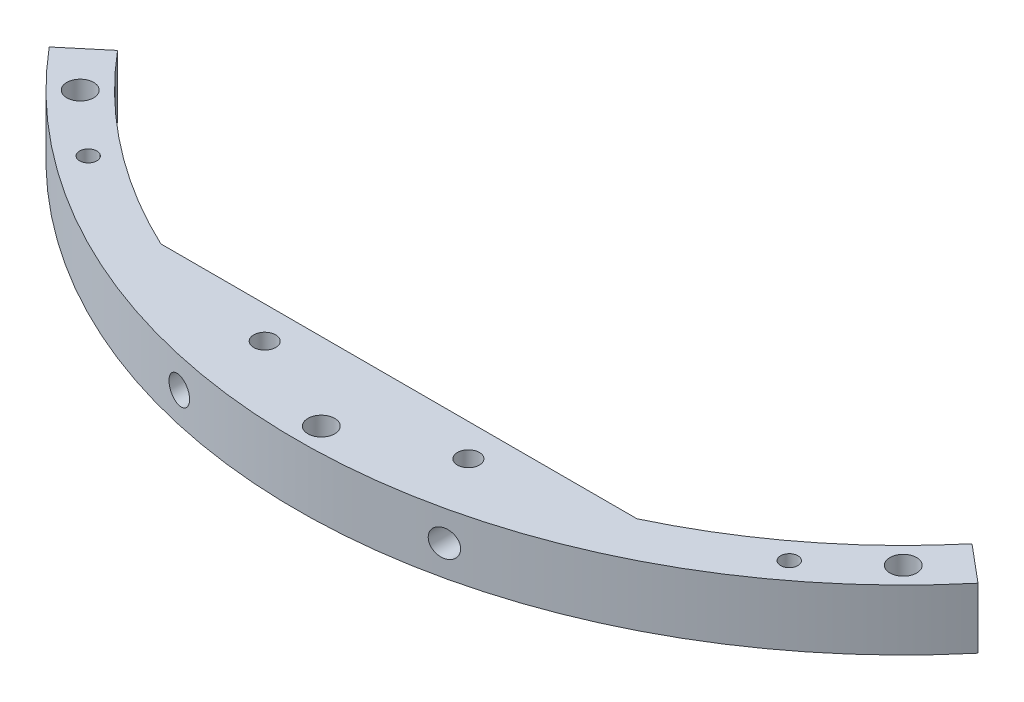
from build123d import *

# Parameters (mm, degrees)
SKETCH1_R          = 1.7272
SKETCH1_R_2        = 2.108199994
SKETCH1_R_3        = 1.352549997
SKETCH1_R_4        = 1.352549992
SKETCH1_R_5        = 2.1082
EXTRUDE1_DEPTH     = 9.525
SKETCH3_R          = 2.0828
CUT_EXTRUDE1_DEPTH = 78.071876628


with BuildPart() as part:
    # Sketch1 → Extrude1 (new body)
    with BuildSketch(Plane(origin=(0, 0, 0), x_dir=(1, 0, 0), z_dir=(0, 1, 0))):
        with BuildLine():
            Line((-67.128474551, -56.327478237), (-72.965733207, -61.225519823))
            ThreePointArc((-72.965733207, -61.225519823), (0, -95.25), (72.965733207, -61.225519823))
            Line((72.965733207, -61.225519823), (67.128474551, -56.327478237))
            ThreePointArc((67.128474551, -56.327478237), (53.506037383, -69.398277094), (37.400152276, -79.248000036))
            Line((37.400152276, -79.248000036), (-37.400152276, -79.248000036))
            ThreePointArc((-37.400152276, -79.248000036), (-53.506037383, -69.398277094), (-67.128474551, -56.327478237))
        make_face()
        with Locations(Location((-16.002, -84.328000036, 0), (0, 0, 90))):
            Circle(SKETCH1_R, mode=Mode.SUBTRACT)
        with Locations(Location((-64.657844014, -64.65784405, 0), (0, 0, 90))):
            Circle(SKETCH1_R_2, mode=Mode.SUBTRACT)
        with Locations(Location((-55.073032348, -72.989793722, 0), (0, 0, 90))):
            Circle(SKETCH1_R_3, mode=Mode.SUBTRACT)
        with Locations(Location((55.073032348, -72.989793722, 0), (0, 0, 90))):
            Circle(SKETCH1_R_4, mode=Mode.SUBTRACT)
        with Locations(Location((64.657844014, -64.65784405, 0), (0, 0, 90))):
            Circle(SKETCH1_R_2, mode=Mode.SUBTRACT)
        with Locations(Location((16.002, -84.328000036, 0), (0, 0, 90))):
            Circle(SKETCH1_R, mode=Mode.SUBTRACT)
        with Locations(Location((0, -91.440000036, 0), (0, 0, 90))):
            Circle(SKETCH1_R_5, mode=Mode.SUBTRACT)
    extrude(amount=EXTRUDE1_DEPTH)

    # Sketch3 → Cut-Extrude1 (cut, through all)
    with BuildSketch(Plane(origin=(0, 0, 79.248000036), x_dir=(-1, 0, 0), z_dir=(0, 0, -1))):
        with Locations((20.828, 4.7625)):
            Circle(SKETCH3_R)
        with Locations((-20.828, 4.7625)):
            Circle(SKETCH3_R)
    extrude(amount=-CUT_EXTRUDE1_DEPTH, mode=Mode.SUBTRACT)


solid = part.part
